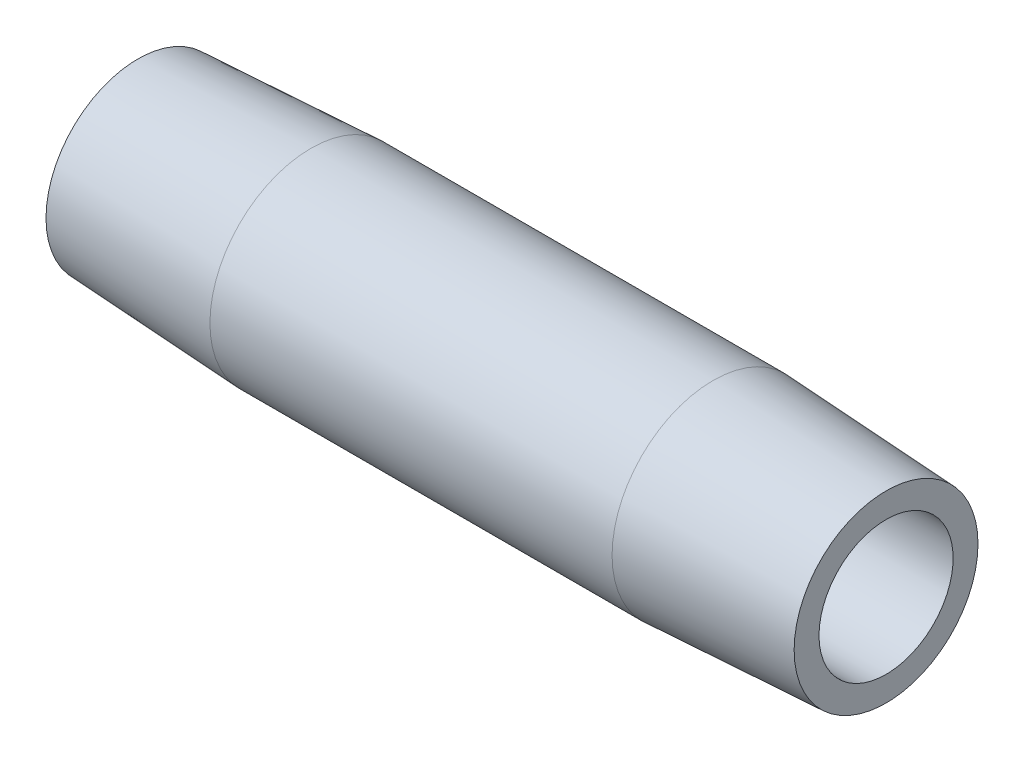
from build123d import *


with BuildPart() as part:
    # Sketch2 → Revolve1 (revolve)
    with BuildSketch(Plane.XY, mode=Mode.PRIVATE) as revolve1_sk:
        Polygon((8.810039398, 5.1435), (0, 4.6817854), (0, 3.4163), (38.1, 3.4163), (38.1, 4.6817854), (29.289960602, 5.1435), align=None)
    revolve(revolve1_sk.sketch.rotate(Axis((0.476141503, 0, 0), (1, 0, 0)), 90), axis=Axis((0.476141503, 0, 0), (1, 0, 0)))


solid = part.part
